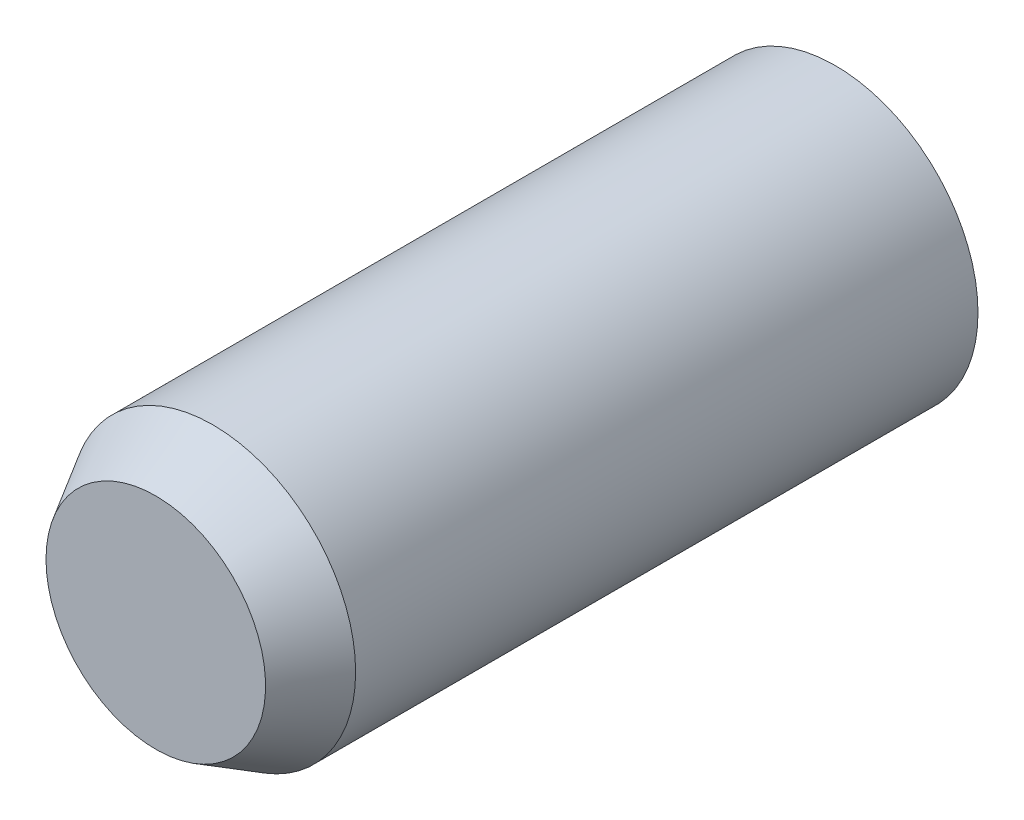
ISO-10303-21;
HEADER;
FILE_DESCRIPTION(('STEP AP214'),'2;1');
FILE_NAME('part.step','',(''),(''),'','','');
FILE_SCHEMA(('AUTOMOTIVE_DESIGN { 1 0 10303 214 1 1 1 1 }'));
ENDSEC;
DATA;
#1=APPLICATION_CONTEXT('core data for automotive mechanical design processes');
#2=APPLICATION_PROTOCOL_DEFINITION('international standard','automotive_design',2000,#1);
#3=PRODUCT_CONTEXT('',#1,'mechanical');
#4=PRODUCT('Part','Part','',(#3));
#5=PRODUCT_RELATED_PRODUCT_CATEGORY('part','',(#4));
#6=PRODUCT_DEFINITION_FORMATION('','',#4);
#7=PRODUCT_DEFINITION_CONTEXT('part definition',#1,'design');
#8=PRODUCT_DEFINITION('design','',#6,#7);
#9=PRODUCT_DEFINITION_SHAPE('','',#8);
#10=(LENGTH_UNIT() NAMED_UNIT(*) SI_UNIT(.MILLI.,.METRE.));
#11=(NAMED_UNIT(*) PLANE_ANGLE_UNIT() SI_UNIT($,.RADIAN.));
#12=(NAMED_UNIT(*) SI_UNIT($,.STERADIAN.) SOLID_ANGLE_UNIT());
#13=UNCERTAINTY_MEASURE_WITH_UNIT(LENGTH_MEASURE(1.E-05),#10,'distance_accuracy_value','');
#14=(GEOMETRIC_REPRESENTATION_CONTEXT(3) GLOBAL_UNCERTAINTY_ASSIGNED_CONTEXT((#13)) GLOBAL_UNIT_ASSIGNED_CONTEXT((#10,
#11,#12)) REPRESENTATION_CONTEXT('',''));
#15=CARTESIAN_POINT('',(0.,0.,0.));
#16=DIRECTION('',(0.,0.,1.));
#17=DIRECTION('',(1.,0.,0.));
#18=AXIS2_PLACEMENT_3D('',#15,#16,#17);
#19=CARTESIAN_POINT('',(226.285935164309,77.9472359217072,-1.1));
#20=DIRECTION('',(0.,0.,1.));
#21=DIRECTION('',(1.,0.,0.));
#22=AXIS2_PLACEMENT_3D('',#19,#20,#21);
#23=PLANE('',#22);
#24=CARTESIAN_POINT('',(226.285935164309,77.9472359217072,-1.09999999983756));
#25=DIRECTION('',(0.,0.,-1.));
#26=DIRECTION('',(-1.,0.,0.));
#27=AXIS2_PLACEMENT_3D('',#24,#25,#26);
#28=CIRCLE('',#27,1.92264973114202);
#29=CARTESIAN_POINT('',(224.363285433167,77.9472359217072,-1.09999999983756));
#30=VERTEX_POINT('',#29);
#31=EDGE_CURVE('E19',#30,#30,#28,.T.);
#32=ORIENTED_EDGE('',*,*,#31,.F.);
#33=EDGE_LOOP('',(#32));
#34=FACE_BOUND('',#33,.T.);
#35=ADVANCED_FACE('F16',(#34),#23,.T.);
#36=CARTESIAN_POINT('',(226.285935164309,77.9472359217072,-13.));
#37=DIRECTION('',(0.,0.,1.));
#38=DIRECTION('',(1.,0.,0.));
#39=AXIS2_PLACEMENT_3D('',#36,#37,#38);
#40=PLANE('',#39);
#41=CARTESIAN_POINT('',(226.285935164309,77.9472359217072,-13.));
#42=DIRECTION('',(0.,0.,1.));
#43=DIRECTION('',(1.,0.,0.));
#44=AXIS2_PLACEMENT_3D('',#41,#42,#43);
#45=CIRCLE('',#44,2.5);
#46=CARTESIAN_POINT('',(228.785935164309,77.9472359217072,-13.));
#47=VERTEX_POINT('',#46);
#48=EDGE_CURVE('E23',#47,#47,#45,.T.);
#49=ORIENTED_EDGE('',*,*,#48,.F.);
#50=EDGE_LOOP('',(#49));
#51=FACE_BOUND('',#50,.T.);
#52=ADVANCED_FACE('F39',(#51),#40,.F.);
#53=CARTESIAN_POINT('',(226.285935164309,77.9472359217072,-2.0999999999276));
#54=DIRECTION('',(0.,0.,-1.));
#55=DIRECTION('',(-1.,0.,0.));
#56=AXIS2_PLACEMENT_3D('',#53,#54,#55);
#57=CONICAL_SURFACE('',#56,2.49999999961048,0.523598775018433);
#58=ORIENTED_EDGE('',*,*,#31,.T.);
#59=EDGE_LOOP('',(#58));
#60=FACE_BOUND('',#59,.T.);
#61=CARTESIAN_POINT('',(226.285935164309,77.9472359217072,-2.1));
#62=DIRECTION('',(0.,0.,1.));
#63=DIRECTION('',(1.,0.,0.));
#64=AXIS2_PLACEMENT_3D('',#61,#62,#63);
#65=CIRCLE('',#64,2.5);
#66=CARTESIAN_POINT('',(228.785935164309,77.9472359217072,-2.1));
#67=VERTEX_POINT('',#66);
#68=EDGE_CURVE('E9',#67,#67,#65,.F.);
#69=ORIENTED_EDGE('',*,*,#68,.F.);
#70=EDGE_LOOP('',(#69));
#71=FACE_BOUND('',#70,.T.);
#72=ADVANCED_FACE('F35',(#60,#71),#57,.T.);
#73=CARTESIAN_POINT('',(226.285935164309,77.9472359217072,-13.3642619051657));
#74=DIRECTION('',(0.,0.,1.));
#75=DIRECTION('',(1.,0.,0.));
#76=AXIS2_PLACEMENT_3D('',#73,#74,#75);
#77=CYLINDRICAL_SURFACE('',#76,2.5);
#78=ORIENTED_EDGE('',*,*,#68,.T.);
#79=EDGE_LOOP('',(#78));
#80=FACE_BOUND('',#79,.T.);
#81=ORIENTED_EDGE('',*,*,#48,.T.);
#82=EDGE_LOOP('',(#81));
#83=FACE_BOUND('',#82,.T.);
#84=ADVANCED_FACE('F45',(#80,#83),#77,.T.);
#85=CLOSED_SHELL('',(#35,#52,#72,#84));
#86=MANIFOLD_SOLID_BREP('B1',#85);
#87=ADVANCED_BREP_SHAPE_REPRESENTATION('',(#18,#86),#14);
#88=SHAPE_DEFINITION_REPRESENTATION(#9,#87);
ENDSEC;
END-ISO-10303-21;
